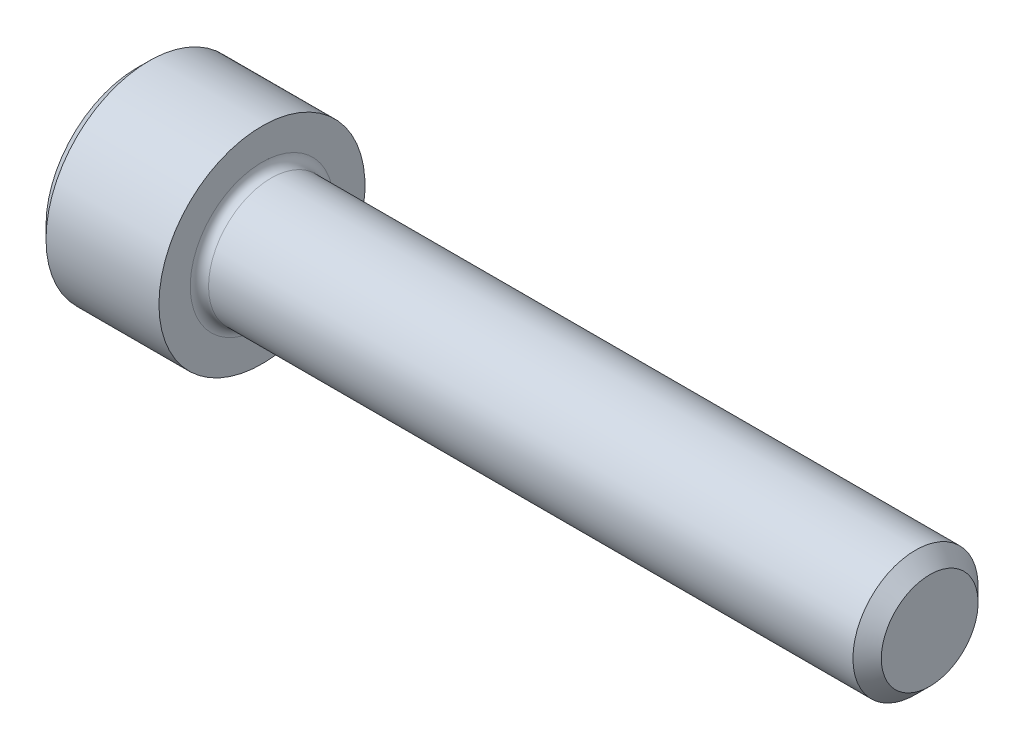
ISO-10303-21;
HEADER;
FILE_DESCRIPTION(('STEP AP214'),'2;1');
FILE_NAME('part.step','',(''),(''),'','','');
FILE_SCHEMA(('AUTOMOTIVE_DESIGN { 1 0 10303 214 1 1 1 1 }'));
ENDSEC;
DATA;
#1=APPLICATION_CONTEXT('core data for automotive mechanical design processes');
#2=APPLICATION_PROTOCOL_DEFINITION('international standard','automotive_design',2000,#1);
#3=PRODUCT_CONTEXT('',#1,'mechanical');
#4=PRODUCT('Part','Part','',(#3));
#5=PRODUCT_RELATED_PRODUCT_CATEGORY('part','',(#4));
#6=PRODUCT_DEFINITION_FORMATION('','',#4);
#7=PRODUCT_DEFINITION_CONTEXT('part definition',#1,'design');
#8=PRODUCT_DEFINITION('design','',#6,#7);
#9=PRODUCT_DEFINITION_SHAPE('','',#8);
#10=(LENGTH_UNIT() NAMED_UNIT(*) SI_UNIT(.MILLI.,.METRE.));
#11=(NAMED_UNIT(*) PLANE_ANGLE_UNIT() SI_UNIT($,.RADIAN.));
#12=(NAMED_UNIT(*) SI_UNIT($,.STERADIAN.) SOLID_ANGLE_UNIT());
#13=UNCERTAINTY_MEASURE_WITH_UNIT(LENGTH_MEASURE(1.E-05),#10,'distance_accuracy_value','');
#14=(GEOMETRIC_REPRESENTATION_CONTEXT(3) GLOBAL_UNCERTAINTY_ASSIGNED_CONTEXT((#13)) GLOBAL_UNIT_ASSIGNED_CONTEXT((#10,
#11,#12)) REPRESENTATION_CONTEXT('',''));
#15=CARTESIAN_POINT('',(0.,0.,0.));
#16=DIRECTION('',(0.,0.,1.));
#17=DIRECTION('',(1.,0.,0.));
#18=AXIS2_PLACEMENT_3D('',#15,#16,#17);
#19=CARTESIAN_POINT('',(0.,0.,0.));
#20=DIRECTION('',(-1.,0.,0.));
#21=DIRECTION('',(0.,0.,1.));
#22=AXIS2_PLACEMENT_3D('',#19,#20,#21);
#23=PLANE('',#22);
#24=DIRECTION('',(0.,-0.499999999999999,0.866025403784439));
#25=VECTOR('',#24,1.);
#26=CARTESIAN_POINT('',(0.,2.05305755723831,0.));
#27=LINE('',#26,#25);
#28=CARTESIAN_POINT('',(0.,2.05305755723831,0.));
#29=VERTEX_POINT('',#28);
#30=CARTESIAN_POINT('',(0.,1.02652877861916,1.778));
#31=VERTEX_POINT('',#30);
#32=EDGE_CURVE('E113',#29,#31,#27,.T.);
#33=ORIENTED_EDGE('',*,*,#32,.T.);
#34=DIRECTION('',(0.,1.,0.));
#35=VECTOR('',#34,1.);
#36=CARTESIAN_POINT('',(0.,-1.02652877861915,1.778));
#37=LINE('',#36,#35);
#38=CARTESIAN_POINT('',(0.,-1.02652877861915,1.778));
#39=VERTEX_POINT('',#38);
#40=EDGE_CURVE('E102',#39,#31,#37,.T.);
#41=ORIENTED_EDGE('',*,*,#40,.F.);
#42=DIRECTION('',(0.,-0.500000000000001,-0.866025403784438));
#43=VECTOR('',#42,1.);
#44=CARTESIAN_POINT('',(0.,-1.02652877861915,1.778));
#45=LINE('',#44,#43);
#46=CARTESIAN_POINT('',(0.,-2.0530575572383,0.));
#47=VERTEX_POINT('',#46);
#48=EDGE_CURVE('E112',#39,#47,#45,.T.);
#49=ORIENTED_EDGE('',*,*,#48,.T.);
#50=DIRECTION('',(0.,0.499999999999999,-0.866025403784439));
#51=VECTOR('',#50,1.);
#52=CARTESIAN_POINT('',(0.,-2.0530575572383,0.));
#53=LINE('',#52,#51);
#54=CARTESIAN_POINT('',(0.,-1.02652877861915,-1.778));
#55=VERTEX_POINT('',#54);
#56=EDGE_CURVE('E127',#47,#55,#53,.T.);
#57=ORIENTED_EDGE('',*,*,#56,.T.);
#58=DIRECTION('',(0.,-1.,0.));
#59=VECTOR('',#58,1.);
#60=CARTESIAN_POINT('',(0.,1.02652877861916,-1.778));
#61=LINE('',#60,#59);
#62=CARTESIAN_POINT('',(0.,1.02652877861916,-1.778));
#63=VERTEX_POINT('',#62);
#64=EDGE_CURVE('E130',#63,#55,#61,.T.);
#65=ORIENTED_EDGE('',*,*,#64,.F.);
#66=DIRECTION('',(0.,-0.500000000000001,-0.866025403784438));
#67=VECTOR('',#66,1.);
#68=CARTESIAN_POINT('',(0.,2.05305755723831,0.));
#69=LINE('',#68,#67);
#70=EDGE_CURVE('E122',#29,#63,#69,.T.);
#71=ORIENTED_EDGE('',*,*,#70,.F.);
#72=EDGE_LOOP('',(#33,#41,#49,#57,#65,#71));
#73=FACE_BOUND('',#72,.T.);
#74=CARTESIAN_POINT('',(0.,0.,0.));
#75=DIRECTION('',(-1.,0.,0.));
#76=DIRECTION('',(0.,0.,1.));
#77=AXIS2_PLACEMENT_3D('',#74,#75,#76);
#78=CIRCLE('',#77,3.0226);
#79=CARTESIAN_POINT('',(0.,0.,3.0226));
#80=VERTEX_POINT('',#79);
#81=EDGE_CURVE('E182',#80,#80,#78,.T.);
#82=ORIENTED_EDGE('',*,*,#81,.T.);
#83=EDGE_LOOP('',(#82));
#84=FACE_BOUND('',#83,.T.);
#85=ADVANCED_FACE('F30',(#73,#84),#23,.T.);
#86=CARTESIAN_POINT('',(0.,0.,0.));
#87=DIRECTION('',(1.,0.,0.));
#88=DIRECTION('',(0.,0.,-1.));
#89=AXIS2_PLACEMENT_3D('',#86,#87,#88);
#90=CONICAL_SURFACE('',#89,3.0226,0.785398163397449);
#91=CARTESIAN_POINT('',(0.406400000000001,0.,0.));
#92=DIRECTION('',(-1.,0.,0.));
#93=DIRECTION('',(0.,0.,1.));
#94=AXIS2_PLACEMENT_3D('',#91,#92,#93);
#95=CIRCLE('',#94,3.429);
#96=CARTESIAN_POINT('',(0.406400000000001,0.,3.429));
#97=VERTEX_POINT('',#96);
#98=EDGE_CURVE('E179',#97,#97,#95,.T.);
#99=ORIENTED_EDGE('',*,*,#98,.T.);
#100=EDGE_LOOP('',(#99));
#101=FACE_BOUND('',#100,.T.);
#102=ORIENTED_EDGE('',*,*,#81,.F.);
#103=EDGE_LOOP('',(#102));
#104=FACE_BOUND('',#103,.T.);
#105=ADVANCED_FACE('F206',(#101,#104),#90,.T.);
#106=CARTESIAN_POINT('',(-31.75,0.,0.));
#107=DIRECTION('',(-1.,0.,0.));
#108=DIRECTION('',(0.,0.,1.));
#109=AXIS2_PLACEMENT_3D('',#106,#107,#108);
#110=CYLINDRICAL_SURFACE('',#109,3.429);
#111=CARTESIAN_POINT('',(4.1656,0.,0.));
#112=DIRECTION('',(-1.,0.,0.));
#113=DIRECTION('',(0.,0.,1.));
#114=AXIS2_PLACEMENT_3D('',#111,#112,#113);
#115=CIRCLE('',#114,3.429);
#116=CARTESIAN_POINT('',(4.1656,0.,3.429));
#117=VERTEX_POINT('',#116);
#118=EDGE_CURVE('E176',#117,#117,#115,.T.);
#119=ORIENTED_EDGE('',*,*,#118,.T.);
#120=EDGE_LOOP('',(#119));
#121=FACE_BOUND('',#120,.T.);
#122=ORIENTED_EDGE('',*,*,#98,.F.);
#123=EDGE_LOOP('',(#122));
#124=FACE_BOUND('',#123,.T.);
#125=ADVANCED_FACE('F210',(#121,#124),#110,.T.);
#126=CARTESIAN_POINT('',(4.1656,3.429,0.));
#127=DIRECTION('',(1.,0.,0.));
#128=DIRECTION('',(0.,0.,-1.));
#129=AXIS2_PLACEMENT_3D('',#126,#127,#128);
#130=PLANE('',#129);
#131=CARTESIAN_POINT('',(4.1656,0.,0.));
#132=DIRECTION('',(1.,0.,0.));
#133=DIRECTION('',(0.,0.,-1.));
#134=AXIS2_PLACEMENT_3D('',#131,#132,#133);
#135=CIRCLE('',#134,2.3876);
#136=CARTESIAN_POINT('',(4.1656,0.,-2.3876));
#137=VERTEX_POINT('',#136);
#138=EDGE_CURVE('E37',#137,#137,#135,.F.);
#139=ORIENTED_EDGE('',*,*,#138,.T.);
#140=EDGE_LOOP('',(#139));
#141=FACE_BOUND('',#140,.T.);
#142=ORIENTED_EDGE('',*,*,#118,.F.);
#143=EDGE_LOOP('',(#142));
#144=FACE_BOUND('',#143,.T.);
#145=ADVANCED_FACE('F187',(#141,#144),#130,.T.);
#146=CARTESIAN_POINT('',(-31.75,0.,0.));
#147=DIRECTION('',(-1.,0.,0.));
#148=DIRECTION('',(0.,0.,1.));
#149=AXIS2_PLACEMENT_3D('',#146,#147,#148);
#150=CYLINDRICAL_SURFACE('',#149,2.0828);
#151=CARTESIAN_POINT('',(4.4704,0.,0.));
#152=DIRECTION('',(1.,0.,0.));
#153=DIRECTION('',(0.,0.,-1.));
#154=AXIS2_PLACEMENT_3D('',#151,#152,#153);
#155=CIRCLE('',#154,2.0828);
#156=CARTESIAN_POINT('',(4.4704,0.,-2.0828));
#157=VERTEX_POINT('',#156);
#158=EDGE_CURVE('E11',#157,#157,#155,.T.);
#159=ORIENTED_EDGE('',*,*,#158,.T.);
#160=EDGE_LOOP('',(#159));
#161=FACE_BOUND('',#160,.T.);
#162=CARTESIAN_POINT('',(25.91816,0.,0.));
#163=DIRECTION('',(-1.,0.,0.));
#164=DIRECTION('',(0.,0.,1.));
#165=AXIS2_PLACEMENT_3D('',#162,#163,#164);
#166=CIRCLE('',#165,2.0828);
#167=CARTESIAN_POINT('',(25.91816,0.,2.0828));
#168=VERTEX_POINT('',#167);
#169=EDGE_CURVE('E173',#168,#168,#166,.T.);
#170=ORIENTED_EDGE('',*,*,#169,.T.);
#171=EDGE_LOOP('',(#170));
#172=FACE_BOUND('',#171,.T.);
#173=ADVANCED_FACE('F221',(#161,#172),#150,.T.);
#174=CARTESIAN_POINT('',(26.3906,0.,0.));
#175=DIRECTION('',(-1.,0.,0.));
#176=DIRECTION('',(0.,0.,1.));
#177=AXIS2_PLACEMENT_3D('',#174,#175,#176);
#178=CONICAL_SURFACE('',#177,1.61036,0.785398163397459);
#179=ORIENTED_EDGE('',*,*,#169,.F.);
#180=EDGE_LOOP('',(#179));
#181=FACE_BOUND('',#180,.T.);
#182=CARTESIAN_POINT('',(26.3906,0.,0.));
#183=DIRECTION('',(-1.,0.,0.));
#184=DIRECTION('',(0.,0.,1.));
#185=AXIS2_PLACEMENT_3D('',#182,#183,#184);
#186=CIRCLE('',#185,1.61036);
#187=CARTESIAN_POINT('',(26.3906,0.,1.61036));
#188=VERTEX_POINT('',#187);
#189=EDGE_CURVE('E169',#188,#188,#186,.T.);
#190=ORIENTED_EDGE('',*,*,#189,.T.);
#191=EDGE_LOOP('',(#190));
#192=FACE_BOUND('',#191,.T.);
#193=ADVANCED_FACE('F200',(#181,#192),#178,.T.);
#194=CARTESIAN_POINT('',(26.3906,1.61036,0.));
#195=DIRECTION('',(1.,0.,0.));
#196=DIRECTION('',(0.,0.,-1.));
#197=AXIS2_PLACEMENT_3D('',#194,#195,#196);
#198=PLANE('',#197);
#199=ORIENTED_EDGE('',*,*,#189,.F.);
#200=EDGE_LOOP('',(#199));
#201=FACE_BOUND('',#200,.T.);
#202=ADVANCED_FACE('F192',(#201),#198,.T.);
#203=CARTESIAN_POINT('',(4.4704,0.,0.));
#204=DIRECTION('',(1.,0.,0.));
#205=DIRECTION('',(0.,0.,-1.));
#206=AXIS2_PLACEMENT_3D('',#203,#204,#205);
#207=TOROIDAL_SURFACE('',#206,2.3876,0.3048);
#208=ORIENTED_EDGE('',*,*,#158,.F.);
#209=EDGE_LOOP('',(#208));
#210=FACE_BOUND('',#209,.T.);
#211=ORIENTED_EDGE('',*,*,#138,.F.);
#212=EDGE_LOOP('',(#211));
#213=FACE_BOUND('',#212,.T.);
#214=ADVANCED_FACE('F190',(#210,#213),#207,.F.);
#215=CARTESIAN_POINT('',(1.9558,2.05305755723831,0.));
#216=DIRECTION('',(0.,-0.86602540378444,-0.499999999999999));
#217=DIRECTION('',(0.,0.499999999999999,-0.86602540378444));
#218=AXIS2_PLACEMENT_3D('',#215,#216,#217);
#219=PLANE('',#218);
#220=ORIENTED_EDGE('',*,*,#32,.F.);
#221=DIRECTION('',(-1.,0.,0.));
#222=VECTOR('',#221,1.);
#223=CARTESIAN_POINT('',(1.9558,2.05305755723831,0.));
#224=LINE('',#223,#222);
#225=CARTESIAN_POINT('',(1.9558,2.05305755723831,0.));
#226=VERTEX_POINT('',#225);
#227=EDGE_CURVE('E154',#226,#29,#224,.T.);
#228=ORIENTED_EDGE('',*,*,#227,.F.);
#229=DIRECTION('',(0.,-0.499999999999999,0.866025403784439));
#230=VECTOR('',#229,1.);
#231=CARTESIAN_POINT('',(1.9558,2.05305755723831,0.));
#232=LINE('',#231,#230);
#233=CARTESIAN_POINT('',(1.9558,1.53979316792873,0.888999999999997));
#234=VERTEX_POINT('',#233);
#235=EDGE_CURVE('E44',#226,#234,#232,.T.);
#236=ORIENTED_EDGE('',*,*,#235,.T.);
#237=CARTESIAN_POINT('',(1.9558,1.02652877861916,1.778));
#238=VERTEX_POINT('',#237);
#239=EDGE_CURVE('E117',#234,#238,#232,.T.);
#240=ORIENTED_EDGE('',*,*,#239,.T.);
#241=DIRECTION('',(-1.,0.,0.));
#242=VECTOR('',#241,1.);
#243=CARTESIAN_POINT('',(1.9558,1.02652877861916,1.778));
#244=LINE('',#243,#242);
#245=EDGE_CURVE('E106',#238,#31,#244,.T.);
#246=ORIENTED_EDGE('',*,*,#245,.T.);
#247=EDGE_LOOP('',(#220,#228,#236,#240,#246));
#248=FACE_BOUND('',#247,.T.);
#249=ADVANCED_FACE('F115',(#248),#219,.T.);
#250=CARTESIAN_POINT('',(1.9558,-1.02652877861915,1.778));
#251=DIRECTION('',(0.,0.,1.));
#252=DIRECTION('',(0.,-1.,0.));
#253=AXIS2_PLACEMENT_3D('',#250,#251,#252);
#254=PLANE('',#253);
#255=ORIENTED_EDGE('',*,*,#40,.T.);
#256=ORIENTED_EDGE('',*,*,#245,.F.);
#257=DIRECTION('',(0.,1.,0.));
#258=VECTOR('',#257,1.);
#259=CARTESIAN_POINT('',(1.9558,-1.02652877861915,1.778));
#260=LINE('',#259,#258);
#261=CARTESIAN_POINT('',(1.9558,0.,1.778));
#262=VERTEX_POINT('',#261);
#263=EDGE_CURVE('E134',#262,#238,#260,.T.);
#264=ORIENTED_EDGE('',*,*,#263,.F.);
#265=CARTESIAN_POINT('',(1.9558,-1.02652877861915,1.778));
#266=VERTEX_POINT('',#265);
#267=EDGE_CURVE('E135',#266,#262,#260,.T.);
#268=ORIENTED_EDGE('',*,*,#267,.F.);
#269=DIRECTION('',(-1.,0.,0.));
#270=VECTOR('',#269,1.);
#271=CARTESIAN_POINT('',(1.9558,-1.02652877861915,1.778));
#272=LINE('',#271,#270);
#273=EDGE_CURVE('E108',#266,#39,#272,.T.);
#274=ORIENTED_EDGE('',*,*,#273,.T.);
#275=EDGE_LOOP('',(#255,#256,#264,#268,#274));
#276=FACE_BOUND('',#275,.T.);
#277=ADVANCED_FACE('F104',(#276),#254,.F.);
#278=CARTESIAN_POINT('',(1.9558,-1.02652877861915,1.778));
#279=DIRECTION('',(0.,0.866025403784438,-0.500000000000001));
#280=DIRECTION('',(0.,0.500000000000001,0.866025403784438));
#281=AXIS2_PLACEMENT_3D('',#278,#279,#280);
#282=PLANE('',#281);
#283=ORIENTED_EDGE('',*,*,#48,.F.);
#284=ORIENTED_EDGE('',*,*,#273,.F.);
#285=DIRECTION('',(0.,-0.500000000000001,-0.866025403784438));
#286=VECTOR('',#285,1.);
#287=CARTESIAN_POINT('',(1.9558,-1.02652877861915,1.778));
#288=LINE('',#287,#286);
#289=CARTESIAN_POINT('',(1.9558,-1.53979316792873,0.889));
#290=VERTEX_POINT('',#289);
#291=EDGE_CURVE('E139',#266,#290,#288,.T.);
#292=ORIENTED_EDGE('',*,*,#291,.T.);
#293=CARTESIAN_POINT('',(1.9558,-2.0530575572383,0.));
#294=VERTEX_POINT('',#293);
#295=EDGE_CURVE('E138',#290,#294,#288,.T.);
#296=ORIENTED_EDGE('',*,*,#295,.T.);
#297=DIRECTION('',(-1.,0.,0.));
#298=VECTOR('',#297,1.);
#299=CARTESIAN_POINT('',(1.9558,-2.0530575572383,0.));
#300=LINE('',#299,#298);
#301=EDGE_CURVE('E162',#294,#47,#300,.T.);
#302=ORIENTED_EDGE('',*,*,#301,.T.);
#303=EDGE_LOOP('',(#283,#284,#292,#296,#302));
#304=FACE_BOUND('',#303,.T.);
#305=ADVANCED_FACE('F275',(#304),#282,.T.);
#306=CARTESIAN_POINT('',(1.9558,-2.0530575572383,0.));
#307=DIRECTION('',(0.,0.866025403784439,0.499999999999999));
#308=DIRECTION('',(0.,-0.499999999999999,0.866025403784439));
#309=AXIS2_PLACEMENT_3D('',#306,#307,#308);
#310=PLANE('',#309);
#311=ORIENTED_EDGE('',*,*,#56,.F.);
#312=ORIENTED_EDGE('',*,*,#301,.F.);
#313=DIRECTION('',(0.,0.499999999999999,-0.866025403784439));
#314=VECTOR('',#313,1.);
#315=CARTESIAN_POINT('',(1.9558,-2.0530575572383,0.));
#316=LINE('',#315,#314);
#317=CARTESIAN_POINT('',(1.9558,-1.53979316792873,-0.888999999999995));
#318=VERTEX_POINT('',#317);
#319=EDGE_CURVE('E143',#294,#318,#316,.T.);
#320=ORIENTED_EDGE('',*,*,#319,.T.);
#321=CARTESIAN_POINT('',(1.9558,-1.02652877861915,-1.778));
#322=VERTEX_POINT('',#321);
#323=EDGE_CURVE('E142',#318,#322,#316,.T.);
#324=ORIENTED_EDGE('',*,*,#323,.T.);
#325=DIRECTION('',(-1.,0.,0.));
#326=VECTOR('',#325,1.);
#327=CARTESIAN_POINT('',(1.9558,-1.02652877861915,-1.778));
#328=LINE('',#327,#326);
#329=EDGE_CURVE('E159',#322,#55,#328,.T.);
#330=ORIENTED_EDGE('',*,*,#329,.T.);
#331=EDGE_LOOP('',(#311,#312,#320,#324,#330));
#332=FACE_BOUND('',#331,.T.);
#333=ADVANCED_FACE('F284',(#332),#310,.T.);
#334=CARTESIAN_POINT('',(1.9558,1.02652877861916,-1.778));
#335=DIRECTION('',(0.,0.,-1.));
#336=DIRECTION('',(0.,1.,0.));
#337=AXIS2_PLACEMENT_3D('',#334,#335,#336);
#338=PLANE('',#337);
#339=ORIENTED_EDGE('',*,*,#64,.T.);
#340=ORIENTED_EDGE('',*,*,#329,.F.);
#341=DIRECTION('',(0.,-1.,0.));
#342=VECTOR('',#341,1.);
#343=CARTESIAN_POINT('',(1.9558,1.02652877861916,-1.778));
#344=LINE('',#343,#342);
#345=CARTESIAN_POINT('',(1.9558,0.,-1.778));
#346=VERTEX_POINT('',#345);
#347=EDGE_CURVE('E146',#346,#322,#344,.T.);
#348=ORIENTED_EDGE('',*,*,#347,.F.);
#349=CARTESIAN_POINT('',(1.9558,1.02652877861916,-1.778));
#350=VERTEX_POINT('',#349);
#351=EDGE_CURVE('E147',#350,#346,#344,.T.);
#352=ORIENTED_EDGE('',*,*,#351,.F.);
#353=DIRECTION('',(-1.,0.,0.));
#354=VECTOR('',#353,1.);
#355=CARTESIAN_POINT('',(1.9558,1.02652877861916,-1.778));
#356=LINE('',#355,#354);
#357=EDGE_CURVE('E156',#350,#63,#356,.T.);
#358=ORIENTED_EDGE('',*,*,#357,.T.);
#359=EDGE_LOOP('',(#339,#340,#348,#352,#358));
#360=FACE_BOUND('',#359,.T.);
#361=ADVANCED_FACE('F294',(#360),#338,.F.);
#362=CARTESIAN_POINT('',(1.9558,2.05305755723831,0.));
#363=DIRECTION('',(0.,0.866025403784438,-0.500000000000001));
#364=DIRECTION('',(0.,0.500000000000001,0.866025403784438));
#365=AXIS2_PLACEMENT_3D('',#362,#363,#364);
#366=PLANE('',#365);
#367=ORIENTED_EDGE('',*,*,#70,.T.);
#368=ORIENTED_EDGE('',*,*,#357,.F.);
#369=DIRECTION('',(0.,-0.500000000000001,-0.866025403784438));
#370=VECTOR('',#369,1.);
#371=CARTESIAN_POINT('',(1.9558,2.05305755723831,0.));
#372=LINE('',#371,#370);
#373=CARTESIAN_POINT('',(1.9558,1.53979316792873,-0.889000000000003));
#374=VERTEX_POINT('',#373);
#375=EDGE_CURVE('E150',#374,#350,#372,.T.);
#376=ORIENTED_EDGE('',*,*,#375,.F.);
#377=EDGE_CURVE('E151',#226,#374,#372,.T.);
#378=ORIENTED_EDGE('',*,*,#377,.F.);
#379=ORIENTED_EDGE('',*,*,#227,.T.);
#380=EDGE_LOOP('',(#367,#368,#376,#378,#379));
#381=FACE_BOUND('',#380,.T.);
#382=ADVANCED_FACE('F304',(#381),#366,.F.);
#383=CARTESIAN_POINT('',(1.9558,1.02652877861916,1.778));
#384=DIRECTION('',(-1.,0.,0.));
#385=DIRECTION('',(0.,0.,1.));
#386=AXIS2_PLACEMENT_3D('',#383,#384,#385);
#387=PLANE('',#386);
#388=CARTESIAN_POINT('',(1.9558,0.,0.));
#389=DIRECTION('',(-1.,0.,0.));
#390=DIRECTION('',(0.,0.,1.));
#391=AXIS2_PLACEMENT_3D('',#388,#389,#390);
#392=CIRCLE('',#391,1.778);
#393=EDGE_CURVE('E118',#290,#262,#392,.T.);
#394=ORIENTED_EDGE('',*,*,#393,.F.);
#395=ORIENTED_EDGE('',*,*,#291,.F.);
#396=ORIENTED_EDGE('',*,*,#267,.T.);
#397=EDGE_LOOP('',(#394,#395,#396));
#398=FACE_BOUND('',#397,.T.);
#399=ADVANCED_FACE('F314',(#398),#387,.T.);
#400=EDGE_CURVE('E390',#318,#290,#392,.T.);
#401=ORIENTED_EDGE('',*,*,#400,.F.);
#402=ORIENTED_EDGE('',*,*,#319,.F.);
#403=ORIENTED_EDGE('',*,*,#295,.F.);
#404=EDGE_LOOP('',(#401,#402,#403));
#405=FACE_BOUND('',#404,.T.);
#406=ADVANCED_FACE('F324',(#405),#387,.T.);
#407=EDGE_CURVE('E391',#346,#318,#392,.T.);
#408=ORIENTED_EDGE('',*,*,#407,.F.);
#409=ORIENTED_EDGE('',*,*,#347,.T.);
#410=ORIENTED_EDGE('',*,*,#323,.F.);
#411=EDGE_LOOP('',(#408,#409,#410));
#412=FACE_BOUND('',#411,.T.);
#413=ADVANCED_FACE('F335',(#412),#387,.T.);
#414=EDGE_CURVE('E394',#374,#346,#392,.T.);
#415=ORIENTED_EDGE('',*,*,#414,.F.);
#416=ORIENTED_EDGE('',*,*,#375,.T.);
#417=ORIENTED_EDGE('',*,*,#351,.T.);
#418=EDGE_LOOP('',(#415,#416,#417));
#419=FACE_BOUND('',#418,.T.);
#420=ADVANCED_FACE('F344',(#419),#387,.T.);
#421=EDGE_CURVE('E170',#234,#374,#392,.T.);
#422=ORIENTED_EDGE('',*,*,#421,.F.);
#423=ORIENTED_EDGE('',*,*,#235,.F.);
#424=ORIENTED_EDGE('',*,*,#377,.T.);
#425=EDGE_LOOP('',(#422,#423,#424));
#426=FACE_BOUND('',#425,.T.);
#427=ADVANCED_FACE('F353',(#426),#387,.T.);
#428=EDGE_CURVE('E166',#262,#234,#392,.T.);
#429=ORIENTED_EDGE('',*,*,#428,.F.);
#430=ORIENTED_EDGE('',*,*,#263,.T.);
#431=ORIENTED_EDGE('',*,*,#239,.F.);
#432=EDGE_LOOP('',(#429,#430,#431));
#433=FACE_BOUND('',#432,.T.);
#434=ADVANCED_FACE('F327',(#433),#387,.T.);
#435=CARTESIAN_POINT('',(1.9558,0.,0.));
#436=DIRECTION('',(-1.,0.,0.));
#437=DIRECTION('',(0.,0.,1.));
#438=AXIS2_PLACEMENT_3D('',#435,#436,#437);
#439=CONICAL_SURFACE('',#438,1.778,1.04719755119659);
#440=CARTESIAN_POINT('',(2.98232877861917,0.,0.));
#441=VERTEX_POINT('',#440);
#442=VERTEX_LOOP('',#441);
#443=FACE_BOUND('',#442,.T.);
#444=ORIENTED_EDGE('',*,*,#428,.T.);
#445=ORIENTED_EDGE('',*,*,#421,.T.);
#446=ORIENTED_EDGE('',*,*,#414,.T.);
#447=ORIENTED_EDGE('',*,*,#407,.T.);
#448=ORIENTED_EDGE('',*,*,#400,.T.);
#449=ORIENTED_EDGE('',*,*,#393,.T.);
#450=EDGE_LOOP('',(#444,#445,#446,#447,#448,#449));
#451=FACE_BOUND('',#450,.T.);
#452=ADVANCED_FACE('F370',(#443,#451),#439,.F.);
#453=CLOSED_SHELL('',(#85,#105,#125,#145,#173,#193,#202,#214,#249,#277,#305,#333,#361,#382,#399,
#406,#413,#420,#427,#434,#452));
#454=MANIFOLD_SOLID_BREP('B2',#453);
#455=ADVANCED_BREP_SHAPE_REPRESENTATION('',(#18,#454),#14);
#456=SHAPE_DEFINITION_REPRESENTATION(#9,#455);
ENDSEC;
END-ISO-10303-21;
